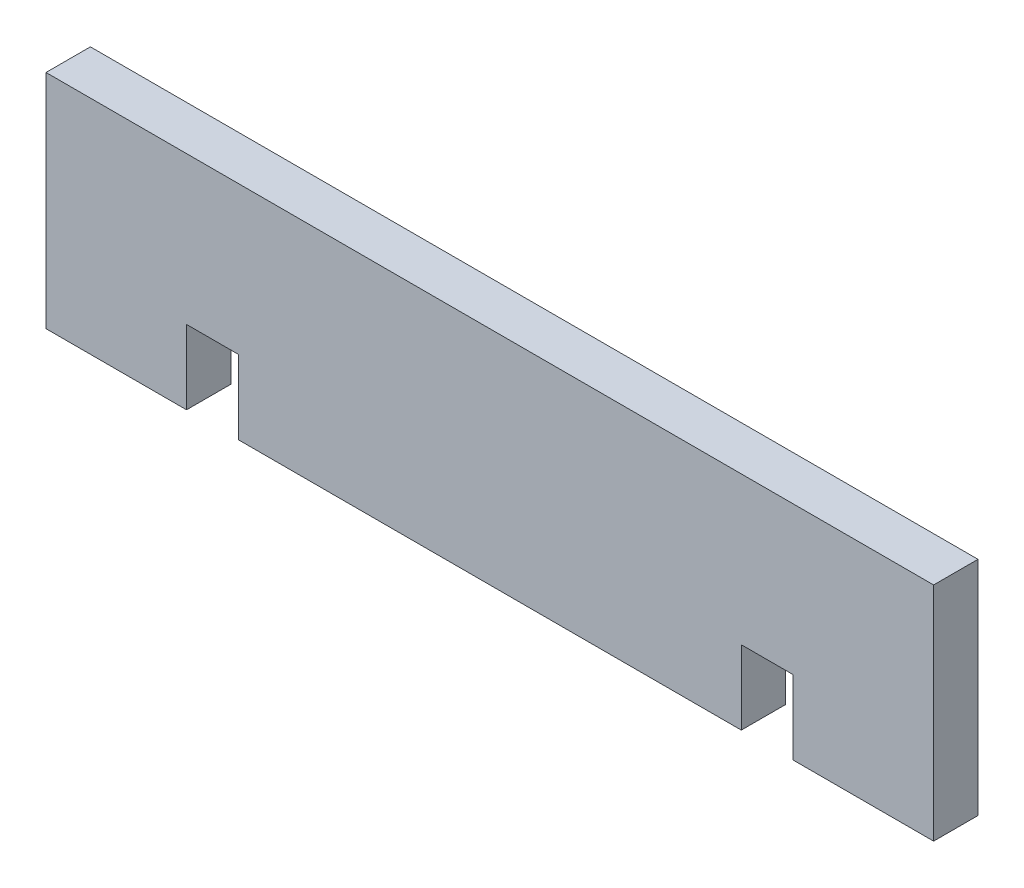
from build123d import *

# Parameters (mm, degrees)
ESQUISSE1_W             = 60
ESQUISSE1_H             = 15
EXTRUSION1_DEPTH        = 3
ESQUISSE2_W             = 3.5
ESQUISSE2_H             = 5
ENL_V_MAT_EXTRU_1_DEPTH = 3


with BuildPart() as part:
    # Esquisse1 → Extrusion1 (new body)
    with BuildSketch(Plane.XY):
        with Locations((30, 7.5)):
            Rectangle(ESQUISSE1_W, ESQUISSE1_H)
    extrude(amount=EXTRUSION1_DEPTH)

    # Esquisse2 → Enl_v. mat.-Extru.1 (cut)
    with BuildSketch(Plane.XY.offset(3)):
        with Locations((11.25, 2.5)):
            Rectangle(ESQUISSE2_W, ESQUISSE2_H)
        with Locations((48.75, 2.5)):
            Rectangle(ESQUISSE2_W, ESQUISSE2_H)
    extrude(amount=-ENL_V_MAT_EXTRU_1_DEPTH, mode=Mode.SUBTRACT)


solid = part.part
